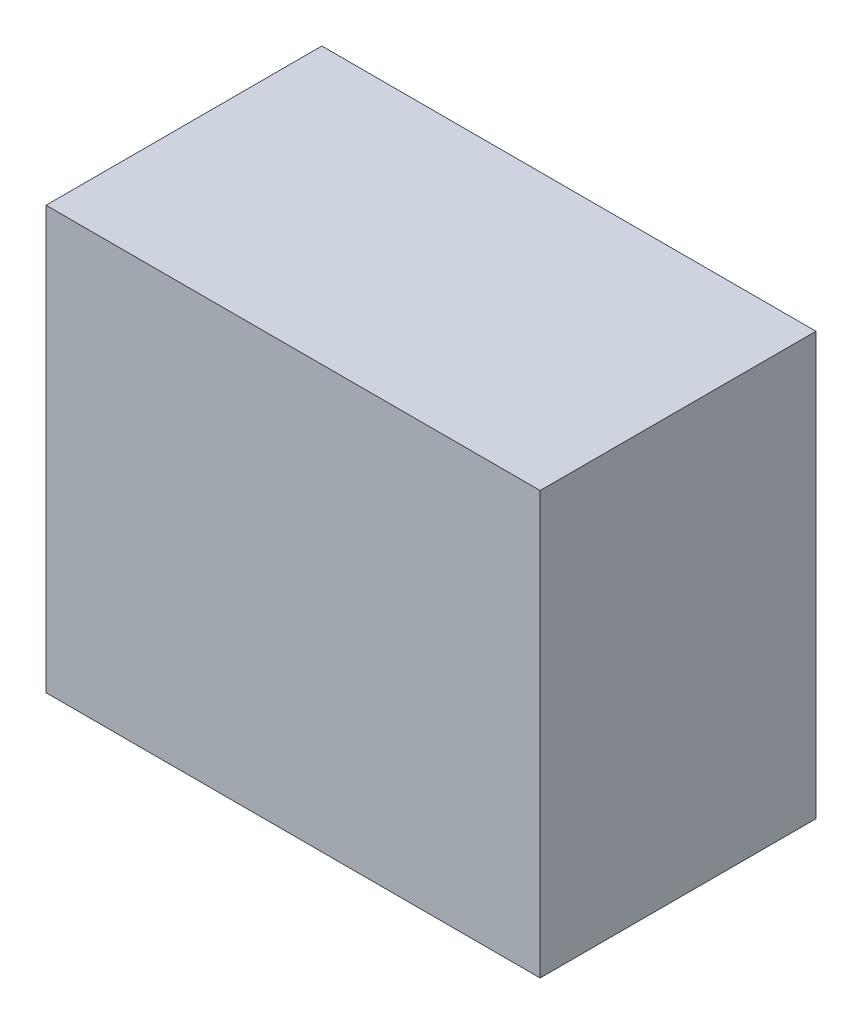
from build123d import *

# Parameters (mm, degrees)
ESQUISSE1_W      = 268.718931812
ESQUISSE1_H      = 229.604515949
EXTRUSION1_DEPTH = 150


with BuildPart() as part:
    # Esquisse1 → Extrusion1 (new body)
    with BuildSketch(Plane.XY):
        with Locations((44.24427065, -47.489692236)):
            Rectangle(ESQUISSE1_W, ESQUISSE1_H)
    extrude(amount=EXTRUSION1_DEPTH)


solid = part.part
